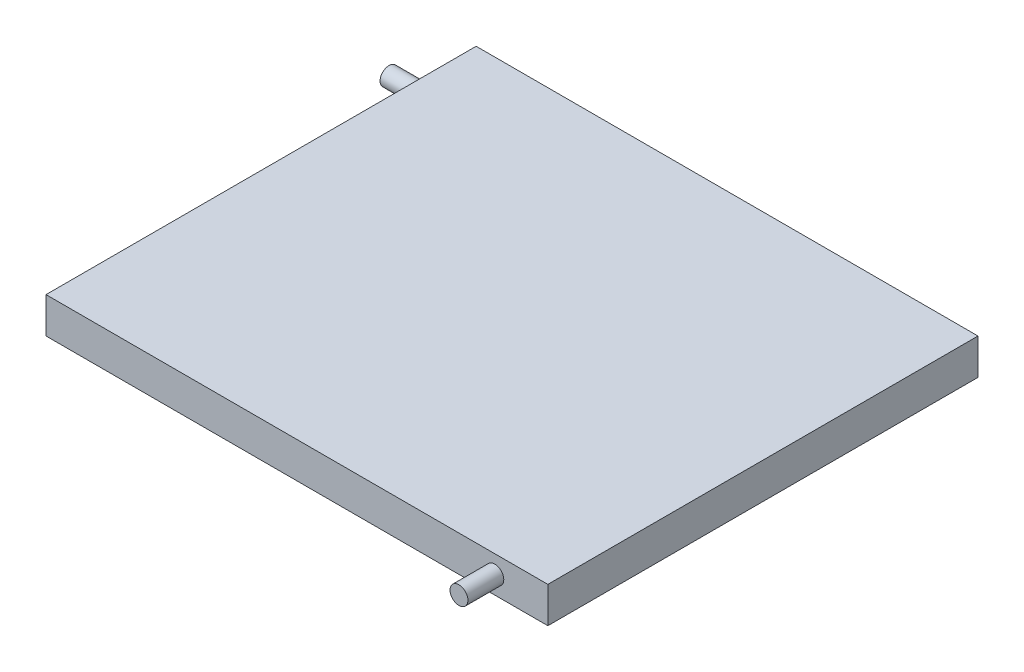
from build123d import *

# Parameters (mm, degrees)
SKETCH1_W      = 355.6
SKETCH1_H      = 304.8
EXTRUDE1_DEPTH = 12.7
SKETCH3_R      = 6.35


with BuildPart() as part:
    # Sketch1 → Extrude1 (new, symmetric)
    with BuildSketch(Plane(origin=(0, 0, 0), x_dir=(1, 0, 0), z_dir=(0, 1, 0))):
        with Locations((177.8, 152.4)):
            Rectangle(SKETCH1_W, SKETCH1_H)
    extrude(amount=EXTRUDE1_DEPTH, both=True)


with BuildPart() as body_2:
    # Sweep1: sweep along a path in Sketch2
    with BuildLine(Plane(origin=(0, 0, 0), x_dir=(1, 0, 0), z_dir=(0, 1, 0))) as sweep1_path:
        Line((-25.4, 268.459925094), (171.92905297, 268.459925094))
        ThreePointArc((171.92905297, 268.459925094), (184.62905297, 255.759925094), (171.92905297, 243.059925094))
        Line((171.92905297, 243.059925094), (42.608360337, 243.059925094))
        ThreePointArc((42.608360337, 243.059925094), (29.908360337, 230.359925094), (42.608360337, 217.659925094))
        Line((42.608360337, 217.659925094), (171.92905297, 217.659925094))
        ThreePointArc((171.92905297, 217.659925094), (184.62905297, 204.959925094), (171.92905297, 192.259925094))
        Line((171.92905297, 192.259925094), (42.608360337, 192.259925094))
        ThreePointArc((42.608360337, 192.259925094), (29.908360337, 179.559925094), (42.608360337, 166.859925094))
        Line((42.608360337, 166.859925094), (171.92905297, 166.859925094))
        ThreePointArc((171.92905297, 166.859925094), (184.62905297, 154.159925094), (171.92905297, 141.459925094))
        Line((171.92905297, 141.459925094), (42.608360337, 141.459925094))
        ThreePointArc((42.608360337, 141.459925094), (29.908360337, 128.759925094), (42.608360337, 116.059925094))
        Line((42.608360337, 116.059925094), (203.728657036, 116.059925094))
        ThreePointArc((203.728657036, 116.059925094), (212.708913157, 112.340181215), (216.428657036, 103.359925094))
        Line((216.428657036, 103.359925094), (216.428657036, 33.506527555))
        ThreePointArc((216.428657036, 33.506527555), (229.128657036, 20.806527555), (241.828657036, 33.506527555))
        Line((241.828657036, 33.506527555), (241.828657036, 103.359925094))
        ThreePointArc((241.828657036, 103.359925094), (254.528657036, 116.059925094), (267.228657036, 103.359925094))
        Line((267.228657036, 103.359925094), (267.228657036, 33.506527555))
        ThreePointArc((267.228657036, 33.506527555), (279.928657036, 20.806527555), (292.628657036, 33.506527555))
        Line((292.628657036, 33.506527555), (292.628657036, 103.359925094))
        ThreePointArc((292.628657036, 103.359925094), (305.328657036, 116.059925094), (318.028657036, 103.359925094))
        Line((318.028657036, 103.359925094), (318.028657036, -25.4))
    # Sketch3 → Sweep1 (sweep)
    with BuildSketch(Plane(origin=(318.028657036, 0, 25.4), x_dir=(1, 0, 0), z_dir=(0, 0, 1))):
        Circle(SKETCH3_R)
    sweep(path=sweep1_path.line)


solid = Compound([part.part, body_2.part])
